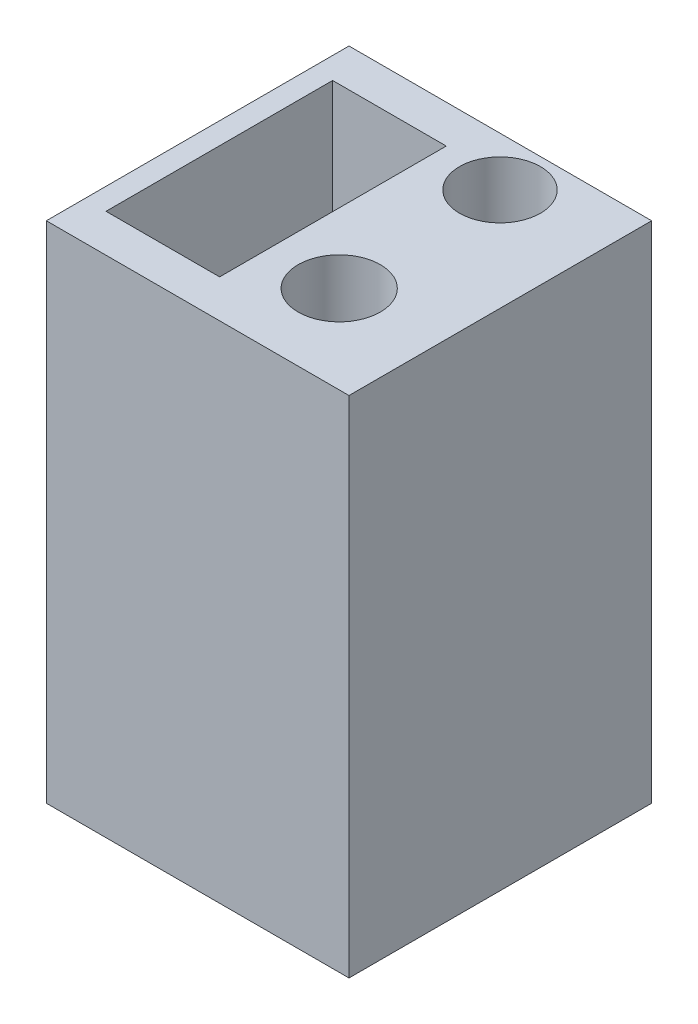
ISO-10303-21;
HEADER;
FILE_DESCRIPTION(('STEP AP214'),'2;1');
FILE_NAME('part.step','',(''),(''),'','','');
FILE_SCHEMA(('AUTOMOTIVE_DESIGN { 1 0 10303 214 1 1 1 1 }'));
ENDSEC;
DATA;
#1=APPLICATION_CONTEXT('core data for automotive mechanical design processes');
#2=APPLICATION_PROTOCOL_DEFINITION('international standard','automotive_design',2000,#1);
#3=PRODUCT_CONTEXT('',#1,'mechanical');
#4=PRODUCT('Part','Part','',(#3));
#5=PRODUCT_RELATED_PRODUCT_CATEGORY('part','',(#4));
#6=PRODUCT_DEFINITION_FORMATION('','',#4);
#7=PRODUCT_DEFINITION_CONTEXT('part definition',#1,'design');
#8=PRODUCT_DEFINITION('design','',#6,#7);
#9=PRODUCT_DEFINITION_SHAPE('','',#8);
#10=(LENGTH_UNIT() NAMED_UNIT(*) SI_UNIT(.MILLI.,.METRE.));
#11=(NAMED_UNIT(*) PLANE_ANGLE_UNIT() SI_UNIT($,.RADIAN.));
#12=(NAMED_UNIT(*) SI_UNIT($,.STERADIAN.) SOLID_ANGLE_UNIT());
#13=UNCERTAINTY_MEASURE_WITH_UNIT(LENGTH_MEASURE(1.E-05),#10,'distance_accuracy_value','');
#14=(GEOMETRIC_REPRESENTATION_CONTEXT(3) GLOBAL_UNCERTAINTY_ASSIGNED_CONTEXT((#13)) GLOBAL_UNIT_ASSIGNED_CONTEXT((#10,
#11,#12)) REPRESENTATION_CONTEXT('',''));
#15=CARTESIAN_POINT('',(0.,0.,0.));
#16=DIRECTION('',(0.,0.,1.));
#17=DIRECTION('',(1.,0.,0.));
#18=AXIS2_PLACEMENT_3D('',#15,#16,#17);
#19=CARTESIAN_POINT('',(15.,50.,15.));
#20=DIRECTION('',(-1.,0.,0.));
#21=DIRECTION('',(0.,0.,1.));
#22=AXIS2_PLACEMENT_3D('',#19,#20,#21);
#23=PLANE('',#22);
#24=DIRECTION('',(0.,0.,-1.));
#25=VECTOR('',#24,1.);
#26=CARTESIAN_POINT('',(15.,0.,15.));
#27=LINE('',#26,#25);
#28=CARTESIAN_POINT('',(15.,0.,15.));
#29=VERTEX_POINT('',#28);
#30=CARTESIAN_POINT('',(15.,0.,-15.));
#31=VERTEX_POINT('',#30);
#32=EDGE_CURVE('E142',#29,#31,#27,.T.);
#33=ORIENTED_EDGE('',*,*,#32,.T.);
#34=DIRECTION('',(0.,-1.,0.));
#35=VECTOR('',#34,1.);
#36=CARTESIAN_POINT('',(15.,50.,-15.));
#37=LINE('',#36,#35);
#38=CARTESIAN_POINT('',(15.,50.,-15.));
#39=VERTEX_POINT('',#38);
#40=EDGE_CURVE('E11',#39,#31,#37,.T.);
#41=ORIENTED_EDGE('',*,*,#40,.F.);
#42=DIRECTION('',(0.,0.,-1.));
#43=VECTOR('',#42,1.);
#44=CARTESIAN_POINT('',(15.,50.,15.));
#45=LINE('',#44,#43);
#46=CARTESIAN_POINT('',(15.,50.,15.));
#47=VERTEX_POINT('',#46);
#48=EDGE_CURVE('E157',#47,#39,#45,.T.);
#49=ORIENTED_EDGE('',*,*,#48,.F.);
#50=DIRECTION('',(0.,-1.,0.));
#51=VECTOR('',#50,1.);
#52=CARTESIAN_POINT('',(15.,50.,15.));
#53=LINE('',#52,#51);
#54=EDGE_CURVE('E163',#47,#29,#53,.T.);
#55=ORIENTED_EDGE('',*,*,#54,.T.);
#56=EDGE_LOOP('',(#33,#41,#49,#55));
#57=FACE_BOUND('',#56,.T.);
#58=ADVANCED_FACE('F33',(#57),#23,.F.);
#59=CARTESIAN_POINT('',(-15.,50.,-15.));
#60=DIRECTION('',(0.,0.,1.));
#61=DIRECTION('',(1.,0.,0.));
#62=AXIS2_PLACEMENT_3D('',#59,#60,#61);
#63=PLANE('',#62);
#64=DIRECTION('',(-1.,0.,0.));
#65=VECTOR('',#64,1.);
#66=CARTESIAN_POINT('',(-15.,0.,-15.));
#67=LINE('',#66,#65);
#68=CARTESIAN_POINT('',(-15.,0.,-15.));
#69=VERTEX_POINT('',#68);
#70=EDGE_CURVE('E166',#31,#69,#67,.T.);
#71=ORIENTED_EDGE('',*,*,#70,.T.);
#72=DIRECTION('',(0.,-1.,0.));
#73=VECTOR('',#72,1.);
#74=CARTESIAN_POINT('',(-15.,50.,-15.));
#75=LINE('',#74,#73);
#76=CARTESIAN_POINT('',(-15.,50.,-15.));
#77=VERTEX_POINT('',#76);
#78=EDGE_CURVE('E40',#77,#69,#75,.T.);
#79=ORIENTED_EDGE('',*,*,#78,.F.);
#80=DIRECTION('',(-1.,0.,0.));
#81=VECTOR('',#80,1.);
#82=CARTESIAN_POINT('',(-15.,50.,-15.));
#83=LINE('',#82,#81);
#84=EDGE_CURVE('E84',#39,#77,#83,.T.);
#85=ORIENTED_EDGE('',*,*,#84,.F.);
#86=ORIENTED_EDGE('',*,*,#40,.T.);
#87=EDGE_LOOP('',(#71,#79,#85,#86));
#88=FACE_BOUND('',#87,.T.);
#89=ADVANCED_FACE('F195',(#88),#63,.F.);
#90=CARTESIAN_POINT('',(-15.,50.,15.));
#91=DIRECTION('',(1.,0.,0.));
#92=DIRECTION('',(0.,0.,-1.));
#93=AXIS2_PLACEMENT_3D('',#90,#91,#92);
#94=PLANE('',#93);
#95=DIRECTION('',(0.,0.,1.));
#96=VECTOR('',#95,1.);
#97=CARTESIAN_POINT('',(-15.,0.,15.));
#98=LINE('',#97,#96);
#99=CARTESIAN_POINT('',(-15.,0.,15.));
#100=VERTEX_POINT('',#99);
#101=EDGE_CURVE('E168',#69,#100,#98,.T.);
#102=ORIENTED_EDGE('',*,*,#101,.T.);
#103=DIRECTION('',(0.,-1.,0.));
#104=VECTOR('',#103,1.);
#105=CARTESIAN_POINT('',(-15.,50.,15.));
#106=LINE('',#105,#104);
#107=CARTESIAN_POINT('',(-15.,50.,15.));
#108=VERTEX_POINT('',#107);
#109=EDGE_CURVE('E172',#108,#100,#106,.T.);
#110=ORIENTED_EDGE('',*,*,#109,.F.);
#111=DIRECTION('',(0.,0.,1.));
#112=VECTOR('',#111,1.);
#113=CARTESIAN_POINT('',(-15.,50.,15.));
#114=LINE('',#113,#112);
#115=EDGE_CURVE('E160',#77,#108,#114,.T.);
#116=ORIENTED_EDGE('',*,*,#115,.F.);
#117=ORIENTED_EDGE('',*,*,#78,.T.);
#118=EDGE_LOOP('',(#102,#110,#116,#117));
#119=FACE_BOUND('',#118,.T.);
#120=ADVANCED_FACE('F177',(#119),#94,.F.);
#121=CARTESIAN_POINT('',(-15.,50.,15.));
#122=DIRECTION('',(0.,0.,-1.));
#123=DIRECTION('',(-1.,0.,0.));
#124=AXIS2_PLACEMENT_3D('',#121,#122,#123);
#125=PLANE('',#124);
#126=DIRECTION('',(1.,0.,0.));
#127=VECTOR('',#126,1.);
#128=CARTESIAN_POINT('',(-15.,0.,15.));
#129=LINE('',#128,#127);
#130=EDGE_CURVE('E77',#100,#29,#129,.T.);
#131=ORIENTED_EDGE('',*,*,#130,.T.);
#132=ORIENTED_EDGE('',*,*,#54,.F.);
#133=DIRECTION('',(1.,0.,0.));
#134=VECTOR('',#133,1.);
#135=CARTESIAN_POINT('',(-15.,50.,15.));
#136=LINE('',#135,#134);
#137=EDGE_CURVE('E56',#108,#47,#136,.T.);
#138=ORIENTED_EDGE('',*,*,#137,.F.);
#139=ORIENTED_EDGE('',*,*,#109,.T.);
#140=EDGE_LOOP('',(#131,#132,#138,#139));
#141=FACE_BOUND('',#140,.T.);
#142=ADVANCED_FACE('F185',(#141),#125,.F.);
#143=CARTESIAN_POINT('',(0.,50.,0.));
#144=DIRECTION('',(0.,-1.,0.));
#145=DIRECTION('',(0.,0.,-1.));
#146=AXIS2_PLACEMENT_3D('',#143,#144,#145);
#147=PLANE('',#146);
#148=DIRECTION('',(-1.,0.,0.));
#149=VECTOR('',#148,1.);
#150=CARTESIAN_POINT('',(-12.8536136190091,50.,-11.2316099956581));
#151=LINE('',#150,#149);
#152=CARTESIAN_POINT('',(-1.59139978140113,50.,-11.2316099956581));
#153=VERTEX_POINT('',#152);
#154=CARTESIAN_POINT('',(-12.8536136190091,50.,-11.2316099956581));
#155=VERTEX_POINT('',#154);
#156=EDGE_CURVE('E135',#153,#155,#151,.T.);
#157=ORIENTED_EDGE('',*,*,#156,.F.);
#158=DIRECTION('',(0.,0.,-1.));
#159=VECTOR('',#158,1.);
#160=CARTESIAN_POINT('',(-1.59139978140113,50.,11.2316099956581));
#161=LINE('',#160,#159);
#162=CARTESIAN_POINT('',(-1.59139978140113,50.,11.2316099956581));
#163=VERTEX_POINT('',#162);
#164=EDGE_CURVE('E47',#163,#153,#161,.T.);
#165=ORIENTED_EDGE('',*,*,#164,.F.);
#166=DIRECTION('',(1.,0.,0.));
#167=VECTOR('',#166,1.);
#168=CARTESIAN_POINT('',(-12.8536136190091,50.,11.2316099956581));
#169=LINE('',#168,#167);
#170=CARTESIAN_POINT('',(-12.8536136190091,50.,11.2316099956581));
#171=VERTEX_POINT('',#170);
#172=EDGE_CURVE('E126',#171,#163,#169,.T.);
#173=ORIENTED_EDGE('',*,*,#172,.F.);
#174=DIRECTION('',(0.,0.,1.));
#175=VECTOR('',#174,1.);
#176=CARTESIAN_POINT('',(-12.8536136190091,50.,11.2316099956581));
#177=LINE('',#176,#175);
#178=EDGE_CURVE('E129',#155,#171,#177,.T.);
#179=ORIENTED_EDGE('',*,*,#178,.F.);
#180=EDGE_LOOP('',(#157,#165,#173,#179));
#181=FACE_BOUND('',#180,.T.);
#182=CARTESIAN_POINT('',(4.83540702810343,50.,-10.1298716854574));
#183=DIRECTION('',(0.,1.,0.));
#184=DIRECTION('',(0.,0.,1.));
#185=AXIS2_PLACEMENT_3D('',#182,#183,#184);
#186=CIRCLE('',#185,4.01038798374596);
#187=CARTESIAN_POINT('',(4.83540702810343,50.,-6.1194837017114));
#188=VERTEX_POINT('',#187);
#189=EDGE_CURVE('E148',#188,#188,#186,.T.);
#190=ORIENTED_EDGE('',*,*,#189,.F.);
#191=EDGE_LOOP('',(#190));
#192=FACE_BOUND('',#191,.T.);
#193=CARTESIAN_POINT('',(5.31821942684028,50.,6.28744852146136));
#194=DIRECTION('',(0.,1.,0.));
#195=DIRECTION('',(0.,0.,1.));
#196=AXIS2_PLACEMENT_3D('',#193,#194,#195);
#197=CIRCLE('',#196,4.07450798);
#198=CARTESIAN_POINT('',(5.31821942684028,50.,10.3619565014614));
#199=VERTEX_POINT('',#198);
#200=EDGE_CURVE('E154',#199,#199,#197,.T.);
#201=ORIENTED_EDGE('',*,*,#200,.F.);
#202=EDGE_LOOP('',(#201));
#203=FACE_BOUND('',#202,.T.);
#204=ORIENTED_EDGE('',*,*,#48,.T.);
#205=ORIENTED_EDGE('',*,*,#84,.T.);
#206=ORIENTED_EDGE('',*,*,#115,.T.);
#207=ORIENTED_EDGE('',*,*,#137,.T.);
#208=EDGE_LOOP('',(#204,#205,#206,#207));
#209=FACE_BOUND('',#208,.T.);
#210=ADVANCED_FACE('F187',(#181,#192,#203,#209),#147,.F.);
#211=CARTESIAN_POINT('',(0.,0.,0.));
#212=DIRECTION('',(0.,-1.,0.));
#213=DIRECTION('',(0.,0.,-1.));
#214=AXIS2_PLACEMENT_3D('',#211,#212,#213);
#215=PLANE('',#214);
#216=ORIENTED_EDGE('',*,*,#32,.F.);
#217=ORIENTED_EDGE('',*,*,#130,.F.);
#218=ORIENTED_EDGE('',*,*,#101,.F.);
#219=ORIENTED_EDGE('',*,*,#70,.F.);
#220=EDGE_LOOP('',(#216,#217,#218,#219));
#221=FACE_BOUND('',#220,.T.);
#222=ADVANCED_FACE('F181',(#221),#215,.T.);
#223=CARTESIAN_POINT('',(5.31821942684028,5.588,6.28744852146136));
#224=DIRECTION('',(0.,1.,0.));
#225=DIRECTION('',(0.,0.,1.));
#226=AXIS2_PLACEMENT_3D('',#223,#224,#225);
#227=CYLINDRICAL_SURFACE('',#226,4.07450798);
#228=CARTESIAN_POINT('',(5.31821942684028,5.588,6.28744852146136));
#229=DIRECTION('',(0.,1.,0.));
#230=DIRECTION('',(0.,0.,1.));
#231=AXIS2_PLACEMENT_3D('',#228,#229,#230);
#232=CIRCLE('',#231,4.07450798);
#233=CARTESIAN_POINT('',(5.31821942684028,5.588,10.3619565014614));
#234=VERTEX_POINT('',#233);
#235=EDGE_CURVE('E151',#234,#234,#232,.T.);
#236=ORIENTED_EDGE('',*,*,#235,.F.);
#237=EDGE_LOOP('',(#236));
#238=FACE_BOUND('',#237,.T.);
#239=ORIENTED_EDGE('',*,*,#200,.T.);
#240=EDGE_LOOP('',(#239));
#241=FACE_BOUND('',#240,.T.);
#242=ADVANCED_FACE('F222',(#238,#241),#227,.F.);
#243=CARTESIAN_POINT('',(5.31821942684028,5.588,6.28744852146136));
#244=DIRECTION('',(0.,1.,0.));
#245=DIRECTION('',(0.,0.,1.));
#246=AXIS2_PLACEMENT_3D('',#243,#244,#245);
#247=PLANE('',#246);
#248=ORIENTED_EDGE('',*,*,#235,.T.);
#249=EDGE_LOOP('',(#248));
#250=FACE_BOUND('',#249,.T.);
#251=ADVANCED_FACE('F235',(#250),#247,.T.);
#252=CARTESIAN_POINT('',(4.83540702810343,5.588,-10.1298716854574));
#253=DIRECTION('',(0.,1.,0.));
#254=DIRECTION('',(0.,0.,1.));
#255=AXIS2_PLACEMENT_3D('',#252,#253,#254);
#256=CYLINDRICAL_SURFACE('',#255,4.01038798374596);
#257=CARTESIAN_POINT('',(4.83540702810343,5.588,-10.1298716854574));
#258=DIRECTION('',(0.,1.,0.));
#259=DIRECTION('',(0.,0.,1.));
#260=AXIS2_PLACEMENT_3D('',#257,#258,#259);
#261=CIRCLE('',#260,4.01038798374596);
#262=CARTESIAN_POINT('',(4.83540702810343,5.588,-6.1194837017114));
#263=VERTEX_POINT('',#262);
#264=EDGE_CURVE('E136',#263,#263,#261,.T.);
#265=ORIENTED_EDGE('',*,*,#264,.F.);
#266=EDGE_LOOP('',(#265));
#267=FACE_BOUND('',#266,.T.);
#268=ORIENTED_EDGE('',*,*,#189,.T.);
#269=EDGE_LOOP('',(#268));
#270=FACE_BOUND('',#269,.T.);
#271=ADVANCED_FACE('F245',(#267,#270),#256,.F.);
#272=CARTESIAN_POINT('',(4.83540702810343,5.588,-10.1298716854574));
#273=DIRECTION('',(0.,1.,0.));
#274=DIRECTION('',(0.,0.,1.));
#275=AXIS2_PLACEMENT_3D('',#272,#273,#274);
#276=PLANE('',#275);
#277=ORIENTED_EDGE('',*,*,#264,.T.);
#278=EDGE_LOOP('',(#277));
#279=FACE_BOUND('',#278,.T.);
#280=ADVANCED_FACE('F255',(#279),#276,.T.);
#281=CARTESIAN_POINT('',(-1.59139978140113,5.588,11.2316099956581));
#282=DIRECTION('',(1.,0.,0.));
#283=DIRECTION('',(0.,0.,-1.));
#284=AXIS2_PLACEMENT_3D('',#281,#282,#283);
#285=PLANE('',#284);
#286=ORIENTED_EDGE('',*,*,#164,.T.);
#287=DIRECTION('',(0.,1.,0.));
#288=VECTOR('',#287,1.);
#289=CARTESIAN_POINT('',(-1.59139978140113,5.588,-11.2316099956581));
#290=LINE('',#289,#288);
#291=CARTESIAN_POINT('',(-1.59139978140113,5.588,-11.2316099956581));
#292=VERTEX_POINT('',#291);
#293=EDGE_CURVE('E104',#292,#153,#290,.T.);
#294=ORIENTED_EDGE('',*,*,#293,.F.);
#295=DIRECTION('',(0.,0.,-1.));
#296=VECTOR('',#295,1.);
#297=CARTESIAN_POINT('',(-1.59139978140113,5.588,11.2316099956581));
#298=LINE('',#297,#296);
#299=CARTESIAN_POINT('',(-1.59139978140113,5.588,11.2316099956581));
#300=VERTEX_POINT('',#299);
#301=EDGE_CURVE('E108',#300,#292,#298,.T.);
#302=ORIENTED_EDGE('',*,*,#301,.F.);
#303=DIRECTION('',(0.,1.,0.));
#304=VECTOR('',#303,1.);
#305=CARTESIAN_POINT('',(-1.59139978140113,5.588,11.2316099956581));
#306=LINE('',#305,#304);
#307=EDGE_CURVE('E140',#300,#163,#306,.T.);
#308=ORIENTED_EDGE('',*,*,#307,.T.);
#309=EDGE_LOOP('',(#286,#294,#302,#308));
#310=FACE_BOUND('',#309,.T.);
#311=ADVANCED_FACE('F106',(#310),#285,.F.);
#312=CARTESIAN_POINT('',(-12.8536136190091,5.588,11.2316099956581));
#313=DIRECTION('',(0.,0.,1.));
#314=DIRECTION('',(1.,0.,0.));
#315=AXIS2_PLACEMENT_3D('',#312,#313,#314);
#316=PLANE('',#315);
#317=ORIENTED_EDGE('',*,*,#172,.T.);
#318=ORIENTED_EDGE('',*,*,#307,.F.);
#319=DIRECTION('',(1.,0.,0.));
#320=VECTOR('',#319,1.);
#321=CARTESIAN_POINT('',(-12.8536136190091,5.588,11.2316099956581));
#322=LINE('',#321,#320);
#323=CARTESIAN_POINT('',(-12.8536136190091,5.588,11.2316099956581));
#324=VERTEX_POINT('',#323);
#325=EDGE_CURVE('E114',#324,#300,#322,.T.);
#326=ORIENTED_EDGE('',*,*,#325,.F.);
#327=DIRECTION('',(0.,1.,0.));
#328=VECTOR('',#327,1.);
#329=CARTESIAN_POINT('',(-12.8536136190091,5.588,11.2316099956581));
#330=LINE('',#329,#328);
#331=EDGE_CURVE('E143',#324,#171,#330,.T.);
#332=ORIENTED_EDGE('',*,*,#331,.T.);
#333=EDGE_LOOP('',(#317,#318,#326,#332));
#334=FACE_BOUND('',#333,.T.);
#335=ADVANCED_FACE('F274',(#334),#316,.F.);
#336=CARTESIAN_POINT('',(-12.8536136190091,5.588,11.2316099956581));
#337=DIRECTION('',(-1.,0.,0.));
#338=DIRECTION('',(0.,0.,1.));
#339=AXIS2_PLACEMENT_3D('',#336,#337,#338);
#340=PLANE('',#339);
#341=ORIENTED_EDGE('',*,*,#178,.T.);
#342=ORIENTED_EDGE('',*,*,#331,.F.);
#343=DIRECTION('',(0.,0.,1.));
#344=VECTOR('',#343,1.);
#345=CARTESIAN_POINT('',(-12.8536136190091,5.588,11.2316099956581));
#346=LINE('',#345,#344);
#347=CARTESIAN_POINT('',(-12.8536136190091,5.588,-11.2316099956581));
#348=VERTEX_POINT('',#347);
#349=EDGE_CURVE('E122',#348,#324,#346,.T.);
#350=ORIENTED_EDGE('',*,*,#349,.F.);
#351=DIRECTION('',(0.,1.,0.));
#352=VECTOR('',#351,1.);
#353=CARTESIAN_POINT('',(-12.8536136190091,5.588,-11.2316099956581));
#354=LINE('',#353,#352);
#355=EDGE_CURVE('E113',#348,#155,#354,.T.);
#356=ORIENTED_EDGE('',*,*,#355,.T.);
#357=EDGE_LOOP('',(#341,#342,#350,#356));
#358=FACE_BOUND('',#357,.T.);
#359=ADVANCED_FACE('F283',(#358),#340,.F.);
#360=CARTESIAN_POINT('',(-12.8536136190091,5.588,-11.2316099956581));
#361=DIRECTION('',(0.,0.,-1.));
#362=DIRECTION('',(-1.,0.,0.));
#363=AXIS2_PLACEMENT_3D('',#360,#361,#362);
#364=PLANE('',#363);
#365=ORIENTED_EDGE('',*,*,#156,.T.);
#366=ORIENTED_EDGE('',*,*,#355,.F.);
#367=DIRECTION('',(-1.,0.,0.));
#368=VECTOR('',#367,1.);
#369=CARTESIAN_POINT('',(-12.8536136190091,5.588,-11.2316099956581));
#370=LINE('',#369,#368);
#371=EDGE_CURVE('E117',#292,#348,#370,.T.);
#372=ORIENTED_EDGE('',*,*,#371,.F.);
#373=ORIENTED_EDGE('',*,*,#293,.T.);
#374=EDGE_LOOP('',(#365,#366,#372,#373));
#375=FACE_BOUND('',#374,.T.);
#376=ADVANCED_FACE('F118',(#375),#364,.F.);
#377=CARTESIAN_POINT('',(0.,5.588,0.));
#378=DIRECTION('',(0.,-1.,0.));
#379=DIRECTION('',(0.,0.,-1.));
#380=AXIS2_PLACEMENT_3D('',#377,#378,#379);
#381=PLANE('',#380);
#382=ORIENTED_EDGE('',*,*,#301,.T.);
#383=ORIENTED_EDGE('',*,*,#371,.T.);
#384=ORIENTED_EDGE('',*,*,#349,.T.);
#385=ORIENTED_EDGE('',*,*,#325,.T.);
#386=EDGE_LOOP('',(#382,#383,#384,#385));
#387=FACE_BOUND('',#386,.T.);
#388=ADVANCED_FACE('F124',(#387),#381,.F.);
#389=CLOSED_SHELL('',(#58,#89,#120,#142,#210,#222,#242,#251,#271,#280,#311,#335,#359,#376,#388));
#390=MANIFOLD_SOLID_BREP('B2',#389);
#391=ADVANCED_BREP_SHAPE_REPRESENTATION('',(#18,#390),#14);
#392=SHAPE_DEFINITION_REPRESENTATION(#9,#391);
ENDSEC;
END-ISO-10303-21;
